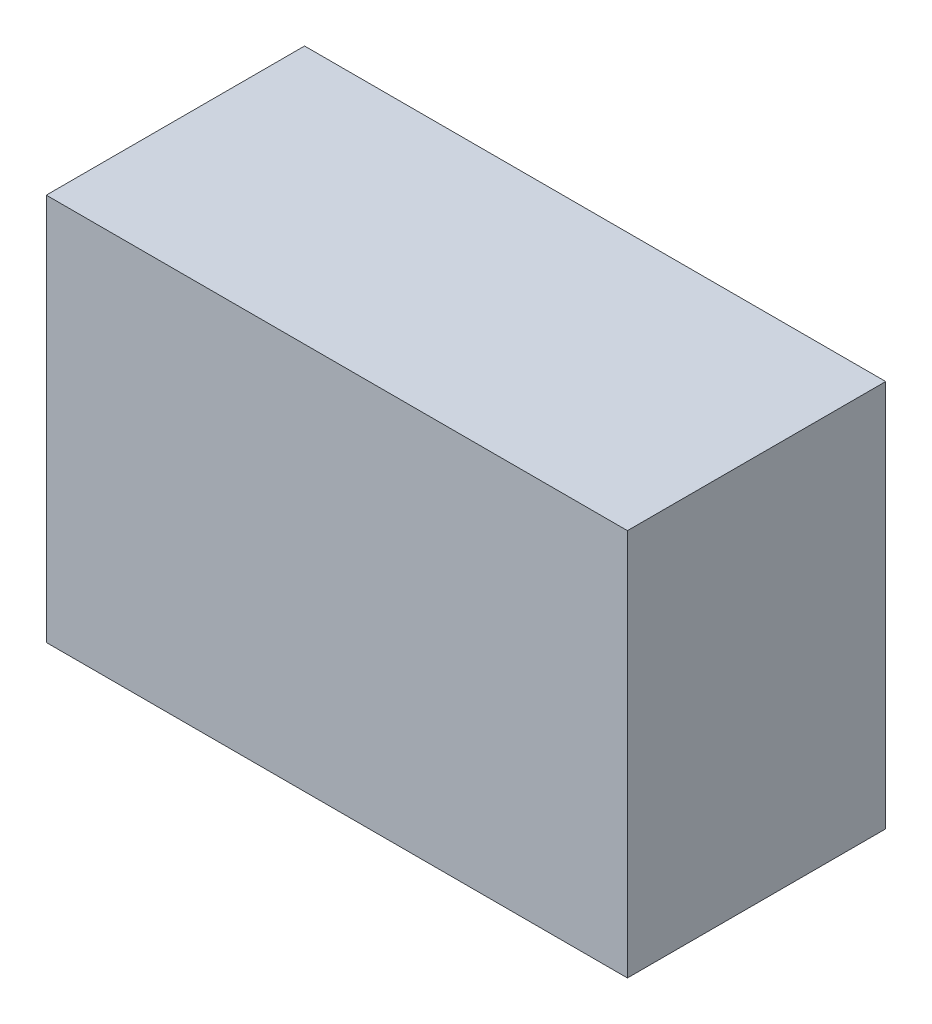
from build123d import *

# Parameters (mm, degrees)
ESQUISSE1_W      = 45
ESQUISSE1_H      = 30
EXTRUSION1_DEPTH = 20


with BuildPart() as part:
    # Esquisse1 → Extrusion1 (new body)
    with BuildSketch(Plane.XY):
        with Locations((157.5, -15)):
            Rectangle(ESQUISSE1_W, ESQUISSE1_H)
    extrude(amount=EXTRUSION1_DEPTH)


solid = part.part
